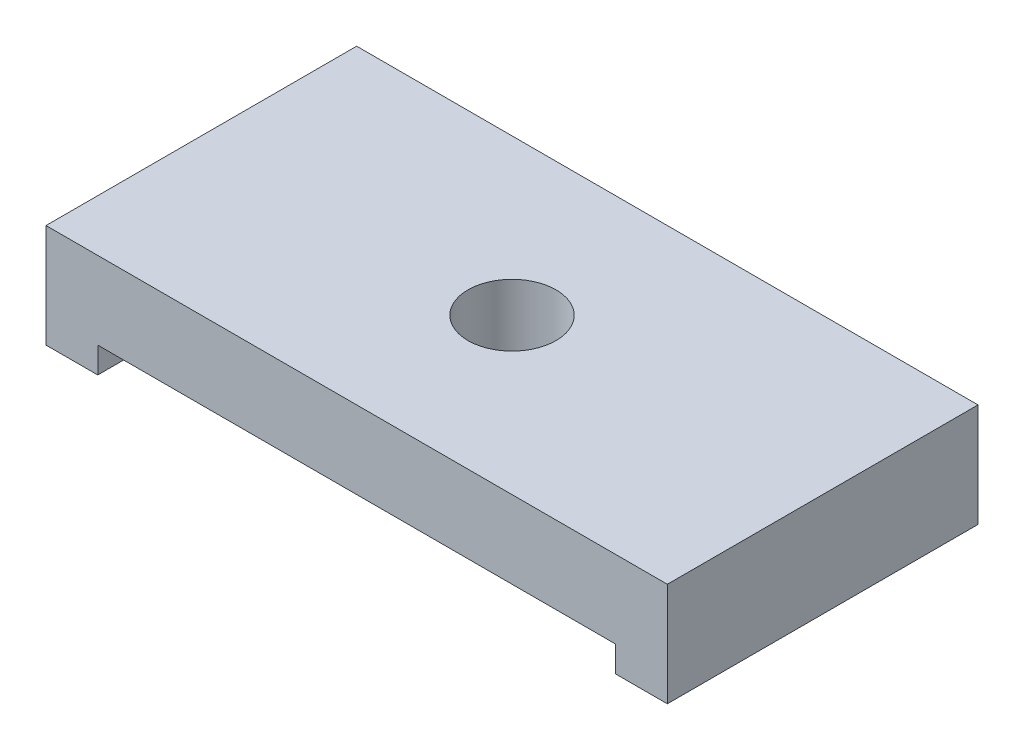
from build123d import *

# Parameters (mm, degrees)
ESQUISSE1_W             = 60
ESQUISSE1_H             = 10
EXTRUSION1_DEPTH        = 30
ESQUISSE2_W             = 50
ESQUISSE2_H             = 2.5
ENL_V_MAT_EXTRU_1_DEPTH = 68.823299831
TROU_TARAUD_M101_D      = 8.5


with BuildPart() as part:
    # Esquisse1 → Extrusion1 (new body)
    with BuildSketch(Plane.XY):
        with Locations((30, 5)):
            Rectangle(ESQUISSE1_W, ESQUISSE1_H)
    extrude(amount=EXTRUSION1_DEPTH)

    # Esquisse2 → Enl_v. mat.-Extru.1 (cut, through all)
    with BuildSketch(Plane.XY.offset(30)):
        with Locations((30, 1.25)):
            Rectangle(ESQUISSE2_W, ESQUISSE2_H)
    extrude(amount=-ENL_V_MAT_EXTRU_1_DEPTH, mode=Mode.SUBTRACT)

    # Trou taraud_ M101 (through all)
    with Locations(Plane(origin=(0, 10, 0), x_dir=(-1, 0, 0), z_dir=(0, 1, 0))):
        with Locations((-30, 15)):
            Hole(TROU_TARAUD_M101_D / 2)


solid = part.part
